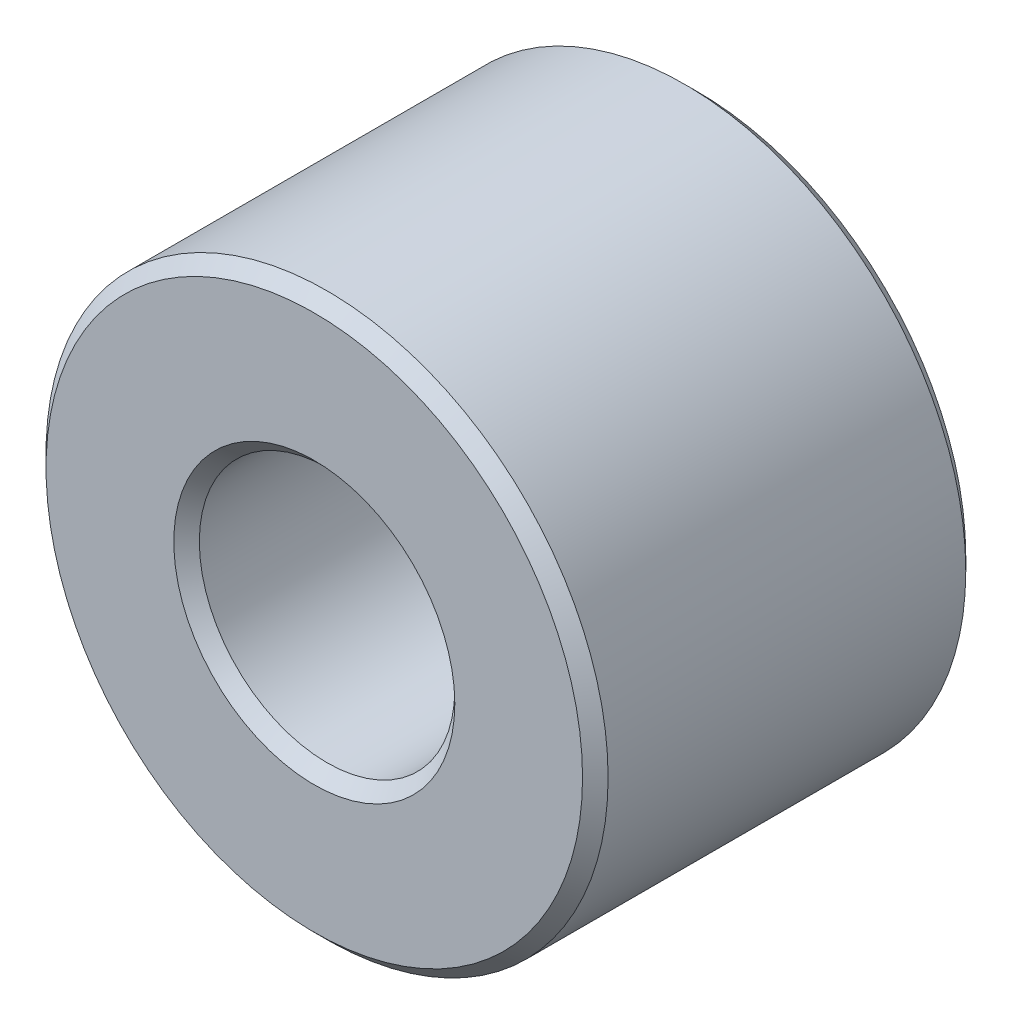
from build123d import *

# Parameters (mm, degrees)
SKETCH1_R           = 11
SKETCH1_R_2         = 5
BOSS_EXTRUDE1_DEPTH = 7.5
CHAMFER1_SIZE       = 0.5


with BuildPart() as part:
    # Sketch1 → Boss-Extrude1 (new, symmetric)
    with BuildSketch(Plane.XY):
        Circle(SKETCH1_R)
        Circle(SKETCH1_R_2, mode=Mode.SUBTRACT)
    extrude(amount=BOSS_EXTRUDE1_DEPTH, both=True)

    # Chamfer1
    chamfer1_edges = [part.edges().sort_by_distance(p)[0] for p in [
        (-11, 0, -7.5),
        (-11, 0, 7.5),
        (-5, 0, -7.5),
        (-5, 0, 7.5),
    ]]
    chamfer(chamfer1_edges, length=CHAMFER1_SIZE)


solid = part.part
